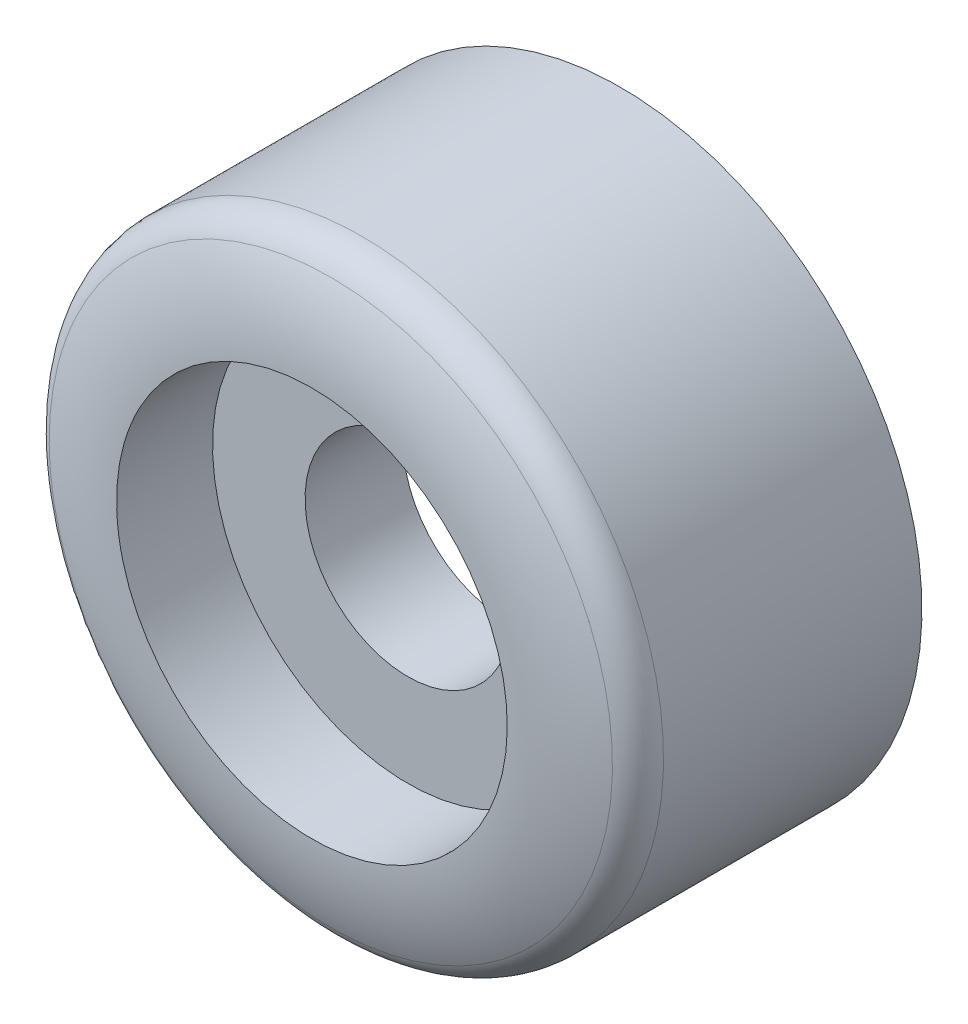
ISO-10303-21;
HEADER;
FILE_DESCRIPTION(('STEP AP214'),'2;1');
FILE_NAME('part.step','',(''),(''),'','','');
FILE_SCHEMA(('AUTOMOTIVE_DESIGN { 1 0 10303 214 1 1 1 1 }'));
ENDSEC;
DATA;
#1=APPLICATION_CONTEXT('core data for automotive mechanical design processes');
#2=APPLICATION_PROTOCOL_DEFINITION('international standard','automotive_design',2000,#1);
#3=PRODUCT_CONTEXT('',#1,'mechanical');
#4=PRODUCT('Part','Part','',(#3));
#5=PRODUCT_RELATED_PRODUCT_CATEGORY('part','',(#4));
#6=PRODUCT_DEFINITION_FORMATION('','',#4);
#7=PRODUCT_DEFINITION_CONTEXT('part definition',#1,'design');
#8=PRODUCT_DEFINITION('design','',#6,#7);
#9=PRODUCT_DEFINITION_SHAPE('','',#8);
#10=(LENGTH_UNIT() NAMED_UNIT(*) SI_UNIT(.MILLI.,.METRE.));
#11=(NAMED_UNIT(*) PLANE_ANGLE_UNIT() SI_UNIT($,.RADIAN.));
#12=(NAMED_UNIT(*) SI_UNIT($,.STERADIAN.) SOLID_ANGLE_UNIT());
#13=UNCERTAINTY_MEASURE_WITH_UNIT(LENGTH_MEASURE(1.E-05),#10,'distance_accuracy_value','');
#14=(GEOMETRIC_REPRESENTATION_CONTEXT(3) GLOBAL_UNCERTAINTY_ASSIGNED_CONTEXT((#13)) GLOBAL_UNIT_ASSIGNED_CONTEXT((#10,
#11,#12)) REPRESENTATION_CONTEXT('',''));
#15=CARTESIAN_POINT('',(0.,0.,0.));
#16=DIRECTION('',(0.,0.,1.));
#17=DIRECTION('',(1.,0.,0.));
#18=AXIS2_PLACEMENT_3D('',#15,#16,#17);
#19=CARTESIAN_POINT('',(0.,0.,19.6184059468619));
#20=DIRECTION('',(0.,0.,-1.));
#21=DIRECTION('',(-0.118736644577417,-0.992925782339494,0.));
#22=AXIS2_PLACEMENT_3D('',#19,#20,#21);
#23=PLANE('',#22);
#24=CARTESIAN_POINT('',(0.,0.,19.6184059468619));
#25=DIRECTION('',(0.,0.,1.));
#26=DIRECTION('',(-0.992925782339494,0.118736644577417,0.));
#27=AXIS2_PLACEMENT_3D('',#24,#25,#26);
#28=CIRCLE('',#27,1.5);
#29=CARTESIAN_POINT('',(-1.48938867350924,0.178104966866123,19.6184059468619));
#30=VERTEX_POINT('',#29);
#31=EDGE_CURVE('E20',#30,#30,#28,.T.);
#32=ORIENTED_EDGE('',*,*,#31,.T.);
#33=EDGE_LOOP('',(#32));
#34=FACE_BOUND('',#33,.T.);
#35=CARTESIAN_POINT('',(0.,0.,19.6184059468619));
#36=DIRECTION('',(0.,0.,-1.));
#37=DIRECTION('',(0.118736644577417,0.992925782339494,0.));
#38=AXIS2_PLACEMENT_3D('',#35,#36,#37);
#39=CIRCLE('',#38,3.95);
#40=CARTESIAN_POINT('',(0.4690097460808,3.922056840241,19.6184059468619));
#41=VERTEX_POINT('',#40);
#42=EDGE_CURVE('E94',#41,#41,#39,.T.);
#43=ORIENTED_EDGE('',*,*,#42,.T.);
#44=EDGE_LOOP('',(#43));
#45=FACE_BOUND('',#44,.T.);
#46=ADVANCED_FACE('F16',(#34,#45),#23,.T.);
#47=CARTESIAN_POINT('',(0.338399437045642,2.82983847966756,21.0484059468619));
#48=DIRECTION('',(0.,0.,-1.));
#49=DIRECTION('',(-0.118736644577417,-0.992925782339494,0.));
#50=AXIS2_PLACEMENT_3D('',#47,#48,#49);
#51=PLANE('',#50);
#52=CARTESIAN_POINT('',(0.,0.,21.0484059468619));
#53=DIRECTION('',(0.,0.,1.));
#54=DIRECTION('',(0.992925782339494,-0.118736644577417,0.));
#55=AXIS2_PLACEMENT_3D('',#52,#53,#54);
#56=CIRCLE('',#55,1.5);
#57=CARTESIAN_POINT('',(1.48938867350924,-0.178104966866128,21.0484059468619));
#58=VERTEX_POINT('',#57);
#59=EDGE_CURVE('E79',#58,#58,#56,.T.);
#60=ORIENTED_EDGE('',*,*,#59,.F.);
#61=EDGE_LOOP('',(#60));
#62=FACE_BOUND('',#61,.T.);
#63=CARTESIAN_POINT('',(0.,0.,21.0484059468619));
#64=DIRECTION('',(0.,0.,1.));
#65=DIRECTION('',(0.992925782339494,-0.118736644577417,0.));
#66=AXIS2_PLACEMENT_3D('',#63,#64,#65);
#67=CIRCLE('',#66,2.85);
#68=CARTESIAN_POINT('',(2.82983847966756,-0.338399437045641,21.0484059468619));
#69=VERTEX_POINT('',#68);
#70=EDGE_CURVE('E11',#69,#69,#67,.T.);
#71=ORIENTED_EDGE('',*,*,#70,.T.);
#72=EDGE_LOOP('',(#71));
#73=FACE_BOUND('',#72,.T.);
#74=ADVANCED_FACE('F125',(#62,#73),#51,.F.);
#75=CARTESIAN_POINT('',(0.,0.,22.4484059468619));
#76=DIRECTION('',(0.,0.,-1.));
#77=DIRECTION('',(0.992925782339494,-0.118736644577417,0.));
#78=AXIS2_PLACEMENT_3D('',#75,#76,#77);
#79=CYLINDRICAL_SURFACE('',#78,2.85);
#80=ORIENTED_EDGE('',*,*,#70,.F.);
#81=EDGE_LOOP('',(#80));
#82=FACE_BOUND('',#81,.T.);
#83=CARTESIAN_POINT('',(0.,0.,22.4484059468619));
#84=DIRECTION('',(0.,0.,1.));
#85=DIRECTION('',(0.992925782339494,-0.118736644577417,0.));
#86=AXIS2_PLACEMENT_3D('',#83,#84,#85);
#87=CIRCLE('',#86,2.85);
#88=CARTESIAN_POINT('',(2.82983847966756,-0.338399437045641,22.4484059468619));
#89=VERTEX_POINT('',#88);
#90=EDGE_CURVE('E26',#89,#89,#87,.T.);
#91=ORIENTED_EDGE('',*,*,#90,.T.);
#92=EDGE_LOOP('',(#91));
#93=FACE_BOUND('',#92,.T.);
#94=ADVANCED_FACE('F121',(#82,#93),#79,.F.);
#95=CARTESIAN_POINT('',(2.82983847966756,-0.338399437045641,22.4484059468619));
#96=CARTESIAN_POINT('',(3.50663735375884,5.32127752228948,22.4484059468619));
#97=CARTESIAN_POINT('',(-2.15303960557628,5.99807639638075,22.4484059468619));
#98=CARTESIAN_POINT('',(-2.82983847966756,0.338399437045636,22.4484059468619));
#99=CARTESIAN_POINT('',(-3.50663735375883,-5.32127752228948,22.4484059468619));
#100=CARTESIAN_POINT('',(2.15303960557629,-5.99807639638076,22.4484059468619));
#101=CARTESIAN_POINT('',(2.82983847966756,-0.338399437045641,22.4484059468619));
#102=CARTESIAN_POINT('',(3.26322655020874,-0.390225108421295,22.4484059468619));
#103=CARTESIAN_POINT('',(4.04367676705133,6.13622799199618,22.4484059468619));
#104=CARTESIAN_POINT('',(-2.48277633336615,6.91667820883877,22.4484059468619));
#105=CARTESIAN_POINT('',(-3.26322655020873,0.39022510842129,22.4484059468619));
#106=CARTESIAN_POINT('',(-4.04367676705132,-6.13622799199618,22.4484059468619));
#107=CARTESIAN_POINT('',(2.48277633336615,-6.91667820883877,22.4484059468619));
#108=CARTESIAN_POINT('',(3.26322655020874,-0.390225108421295,22.4484059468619));
#109=CARTESIAN_POINT('',(3.68655452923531,-0.440847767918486,22.3549078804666));
#110=CARTESIAN_POINT('',(4.56825006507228,6.93226129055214,22.3549078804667));
#111=CARTESIAN_POINT('',(-2.80485899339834,7.8139568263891,22.3549078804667));
#112=CARTESIAN_POINT('',(-3.68655452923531,0.440847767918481,22.3549078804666));
#113=CARTESIAN_POINT('',(-4.56825006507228,-6.93226129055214,22.3549078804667));
#114=CARTESIAN_POINT('',(2.80485899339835,-7.81395682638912,22.3549078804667));
#115=CARTESIAN_POINT('',(3.68655452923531,-0.440847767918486,22.3549078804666));
#116=CARTESIAN_POINT('',(4.08016927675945,-0.487917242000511,22.1722524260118));
#117=CARTESIAN_POINT('',(5.05600376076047,7.67242131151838,22.1722524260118));
#118=CARTESIAN_POINT('',(-3.10433479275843,8.64825579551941,22.1722524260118));
#119=CARTESIAN_POINT('',(-4.08016927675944,0.487917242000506,22.1722524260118));
#120=CARTESIAN_POINT('',(-5.05600376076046,-7.67242131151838,22.1722524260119));
#121=CARTESIAN_POINT('',(3.10433479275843,-8.64825579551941,22.1722524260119));
#122=CARTESIAN_POINT('',(4.08016927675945,-0.487917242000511,22.1722524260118));
#123=(BOUNDED_SURFACE() B_SPLINE_SURFACE(3,3,((#95,#96,#97,#98,#99,#100,#101),(#102,#103,#104,
#105,#106,#107,#108),(#109,#110,#111,#112,#113,#114,#115),(#116,#117,#118,#119,#120,#121,#122)),
.UNSPECIFIED.,.F.,.T.,.F.) B_SPLINE_SURFACE_WITH_KNOTS((4,4),(4,3,4),(0.,6.28318530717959),
(1.13902760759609,1.35491196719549,1.5707963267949),
.UNSPECIFIED.) GEOMETRIC_REPRESENTATION_ITEM() RATIONAL_B_SPLINE_SURFACE(((1.,0.333333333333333,
0.333333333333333,1.,0.333333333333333,0.333333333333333,1.),(0.984524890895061,
0.328174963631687,0.328174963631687,0.984524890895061,0.328174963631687,0.328174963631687,
0.984524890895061),(0.984524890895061,0.328174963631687,0.328174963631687,0.984524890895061,
0.328174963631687,0.328174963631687,0.984524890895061),(1.,0.333333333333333,0.333333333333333,
1.,0.333333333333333,0.333333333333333,1.))) REPRESENTATION_ITEM('') SURFACE());
#124=CARTESIAN_POINT('',(0.,0.,22.1722524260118));
#125=DIRECTION('',(0.,0.,1.));
#126=DIRECTION('',(0.992925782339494,-0.118736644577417,0.));
#127=AXIS2_PLACEMENT_3D('',#124,#125,#126);
#128=CIRCLE('',#127,4.10923892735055);
#129=CARTESIAN_POINT('',(4.08016927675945,-0.487917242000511,22.1722524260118));
#130=VERTEX_POINT('',#129);
#131=EDGE_CURVE('E97',#130,#130,#128,.T.);
#132=ORIENTED_EDGE('',*,*,#90,.F.);
#133=EDGE_LOOP('',(#132));
#134=FACE_BOUND('',#133,.T.);
#135=ORIENTED_EDGE('',*,*,#131,.T.);
#136=EDGE_LOOP('',(#135));
#137=FACE_BOUND('',#136,.T.);
#138=ADVANCED_FACE('F109',(#134,#137),#123,.T.);
#139=CARTESIAN_POINT('',(0.,0.,21.7181389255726));
#140=DIRECTION('',(0.,0.,1.));
#141=DIRECTION('',(0.992925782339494,-0.118736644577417,0.));
#142=AXIS2_PLACEMENT_3D('',#139,#140,#141);
#143=TOROIDAL_SURFACE('',#142,3.9,0.5);
#144=ORIENTED_EDGE('',*,*,#131,.F.);
#145=EDGE_LOOP('',(#144));
#146=FACE_BOUND('',#145,.T.);
#147=CARTESIAN_POINT('',(0.,0.,21.7181389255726));
#148=DIRECTION('',(0.,0.,1.));
#149=DIRECTION('',(0.992925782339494,-0.118736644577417,0.));
#150=AXIS2_PLACEMENT_3D('',#147,#148,#149);
#151=CIRCLE('',#150,4.4);
#152=CARTESIAN_POINT('',(4.36887344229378,-0.522441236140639,21.7181389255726));
#153=VERTEX_POINT('',#152);
#154=EDGE_CURVE('E55',#153,#153,#151,.T.);
#155=ORIENTED_EDGE('',*,*,#154,.T.);
#156=EDGE_LOOP('',(#155));
#157=FACE_BOUND('',#156,.T.);
#158=ADVANCED_FACE('F18',(#146,#157),#143,.T.);
#159=CARTESIAN_POINT('',(0.,0.,22.4484059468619));
#160=DIRECTION('',(0.,0.,-1.));
#161=DIRECTION('',(0.992925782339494,-0.118736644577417,0.));
#162=AXIS2_PLACEMENT_3D('',#159,#160,#161);
#163=CYLINDRICAL_SURFACE('',#162,4.4);
#164=ORIENTED_EDGE('',*,*,#154,.F.);
#165=EDGE_LOOP('',(#164));
#166=FACE_BOUND('',#165,.T.);
#167=CARTESIAN_POINT('',(0.,0.,17.9484059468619));
#168=DIRECTION('',(0.,0.,1.));
#169=DIRECTION('',(0.992925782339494,-0.118736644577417,0.));
#170=AXIS2_PLACEMENT_3D('',#167,#168,#169);
#171=CIRCLE('',#170,4.4);
#172=CARTESIAN_POINT('',(4.36887344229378,-0.522441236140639,17.9484059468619));
#173=VERTEX_POINT('',#172);
#174=EDGE_CURVE('E64',#173,#173,#171,.T.);
#175=ORIENTED_EDGE('',*,*,#174,.T.);
#176=EDGE_LOOP('',(#175));
#177=FACE_BOUND('',#176,.T.);
#178=ADVANCED_FACE('F112',(#166,#177),#163,.T.);
#179=CARTESIAN_POINT('',(0.178104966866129,1.48938867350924,17.9484059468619));
#180=DIRECTION('',(0.,0.,1.));
#181=DIRECTION('',(0.992925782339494,-0.118736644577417,0.));
#182=AXIS2_PLACEMENT_3D('',#179,#180,#181);
#183=PLANE('',#182);
#184=CARTESIAN_POINT('',(0.,0.,17.9484059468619));
#185=DIRECTION('',(0.,0.,-1.));
#186=DIRECTION('',(0.118736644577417,0.992925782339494,0.));
#187=AXIS2_PLACEMENT_3D('',#184,#185,#186);
#188=CIRCLE('',#187,3.95);
#189=CARTESIAN_POINT('',(0.4690097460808,3.922056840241,17.9484059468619));
#190=VERTEX_POINT('',#189);
#191=EDGE_CURVE('E90',#190,#190,#188,.T.);
#192=ORIENTED_EDGE('',*,*,#191,.F.);
#193=EDGE_LOOP('',(#192));
#194=FACE_BOUND('',#193,.T.);
#195=ORIENTED_EDGE('',*,*,#174,.F.);
#196=EDGE_LOOP('',(#195));
#197=FACE_BOUND('',#196,.T.);
#198=ADVANCED_FACE('F118',(#194,#197),#183,.F.);
#199=CARTESIAN_POINT('',(0.,0.,19.6184059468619));
#200=DIRECTION('',(0.,0.,1.));
#201=DIRECTION('',(-0.992925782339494,0.118736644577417,0.));
#202=AXIS2_PLACEMENT_3D('',#199,#200,#201);
#203=CYLINDRICAL_SURFACE('',#202,3.95);
#204=ORIENTED_EDGE('',*,*,#42,.F.);
#205=EDGE_LOOP('',(#204));
#206=FACE_BOUND('',#205,.T.);
#207=ORIENTED_EDGE('',*,*,#191,.T.);
#208=EDGE_LOOP('',(#207));
#209=FACE_BOUND('',#208,.T.);
#210=ADVANCED_FACE('F177',(#206,#209),#203,.F.);
#211=CARTESIAN_POINT('',(0.,0.,22.4484059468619));
#212=DIRECTION('',(0.,0.,-1.));
#213=DIRECTION('',(0.992925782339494,-0.118736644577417,0.));
#214=AXIS2_PLACEMENT_3D('',#211,#212,#213);
#215=CYLINDRICAL_SURFACE('',#214,1.5);
#216=ORIENTED_EDGE('',*,*,#59,.T.);
#217=EDGE_LOOP('',(#216));
#218=FACE_BOUND('',#217,.T.);
#219=ORIENTED_EDGE('',*,*,#31,.F.);
#220=EDGE_LOOP('',(#219));
#221=FACE_BOUND('',#220,.T.);
#222=ADVANCED_FACE('F187',(#218,#221),#215,.F.);
#223=CLOSED_SHELL('',(#46,#74,#94,#138,#158,#178,#198,#210,#222));
#224=MANIFOLD_SOLID_BREP('B1',#223);
#225=ADVANCED_BREP_SHAPE_REPRESENTATION('',(#18,#224),#14);
#226=SHAPE_DEFINITION_REPRESENTATION(#9,#225);
ENDSEC;
END-ISO-10303-21;
